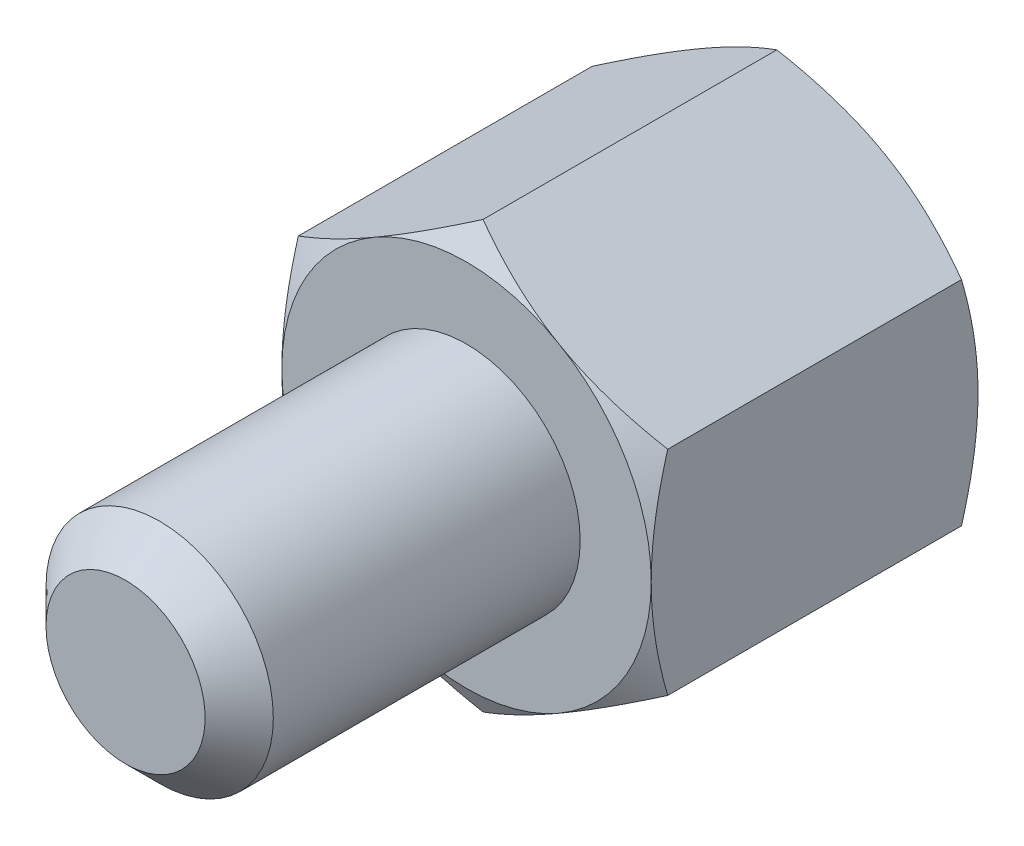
ISO-10303-21;
HEADER;
FILE_DESCRIPTION(('STEP AP214'),'2;1');
FILE_NAME('part.step','',(''),(''),'','','');
FILE_SCHEMA(('AUTOMOTIVE_DESIGN { 1 0 10303 214 1 1 1 1 }'));
ENDSEC;
DATA;
#1=APPLICATION_CONTEXT('core data for automotive mechanical design processes');
#2=APPLICATION_PROTOCOL_DEFINITION('international standard','automotive_design',2000,#1);
#3=PRODUCT_CONTEXT('',#1,'mechanical');
#4=PRODUCT('Part','Part','',(#3));
#5=PRODUCT_RELATED_PRODUCT_CATEGORY('part','',(#4));
#6=PRODUCT_DEFINITION_FORMATION('','',#4);
#7=PRODUCT_DEFINITION_CONTEXT('part definition',#1,'design');
#8=PRODUCT_DEFINITION('design','',#6,#7);
#9=PRODUCT_DEFINITION_SHAPE('','',#8);
#10=(LENGTH_UNIT() NAMED_UNIT(*) SI_UNIT(.MILLI.,.METRE.));
#11=(NAMED_UNIT(*) PLANE_ANGLE_UNIT() SI_UNIT($,.RADIAN.));
#12=(NAMED_UNIT(*) SI_UNIT($,.STERADIAN.) SOLID_ANGLE_UNIT());
#13=UNCERTAINTY_MEASURE_WITH_UNIT(LENGTH_MEASURE(1.E-05),#10,'distance_accuracy_value','');
#14=(GEOMETRIC_REPRESENTATION_CONTEXT(3) GLOBAL_UNCERTAINTY_ASSIGNED_CONTEXT((#13)) GLOBAL_UNIT_ASSIGNED_CONTEXT((#10,
#11,#12)) REPRESENTATION_CONTEXT('',''));
#15=CARTESIAN_POINT('',(0.,0.,0.));
#16=DIRECTION('',(0.,0.,1.));
#17=DIRECTION('',(1.,0.,0.));
#18=AXIS2_PLACEMENT_3D('',#15,#16,#17);
#19=CARTESIAN_POINT('',(0.,-7.50555349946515,25.));
#20=DIRECTION('',(-0.5,-0.866025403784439,0.));
#21=DIRECTION('',(-0.866025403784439,0.5,0.));
#22=AXIS2_PLACEMENT_3D('',#19,#20,#21);
#23=PLANE('',#22);
#24=DIRECTION('',(0.,0.,-1.));
#25=VECTOR('',#24,1.);
#26=CARTESIAN_POINT('',(-6.5,-3.75277674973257,25.));
#27=LINE('',#26,#25);
#28=CARTESIAN_POINT('',(-6.5,-3.75277674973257,12.4194434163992));
#29=VERTEX_POINT('',#28);
#30=CARTESIAN_POINT('',(-6.5,-3.75277674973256,2.08055658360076));
#31=VERTEX_POINT('',#30);
#32=EDGE_CURVE('E134',#29,#31,#27,.T.);
#33=ORIENTED_EDGE('',*,*,#32,.T.);
#34=CARTESIAN_POINT('',(-6.5002,-3.75266127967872,2.08062325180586));
#35=CARTESIAN_POINT('',(-6.35732254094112,-3.8351516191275,2.03300442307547));
#36=CARTESIAN_POINT('',(-6.21391236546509,-3.91794952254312,1.98754670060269));
#37=CARTESIAN_POINT('',(-5.92592736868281,-4.08421773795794,1.90154868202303));
#38=CARTESIAN_POINT('',(-5.78135207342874,-4.16768832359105,1.86101050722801));
#39=CARTESIAN_POINT('',(-5.34531134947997,-4.41943655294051,1.74757100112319));
#40=CARTESIAN_POINT('',(-5.05212471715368,-4.58870793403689,1.68304780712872));
#41=CARTESIAN_POINT('',(-4.61337625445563,-4.84201947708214,1.60738658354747));
#42=CARTESIAN_POINT('',(-4.46912536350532,-4.92530276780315,1.58583285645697));
#43=CARTESIAN_POINT('',(-4.17997178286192,-5.09224566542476,1.5496903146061));
#44=CARTESIAN_POINT('',(-4.03506915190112,-5.17590523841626,1.53510088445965));
#45=CARTESIAN_POINT('',(-3.74501222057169,-5.34336968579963,1.51325875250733));
#46=CARTESIAN_POINT('',(-3.5998583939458,-5.42717428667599,1.50599772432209));
#47=CARTESIAN_POINT('',(-3.30942466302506,-5.59485627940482,1.49896030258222));
#48=CARTESIAN_POINT('',(-3.16414476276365,-5.67873366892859,1.4991836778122));
#49=CARTESIAN_POINT('',(-2.76612405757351,-5.90853103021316,1.51008345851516));
#50=CARTESIAN_POINT('',(-2.51351353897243,-6.05437578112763,1.5283818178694));
#51=CARTESIAN_POINT('',(-2.00997032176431,-6.34509659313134,1.58640634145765));
#52=CARTESIAN_POINT('',(-1.7590393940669,-6.48997163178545,1.62615233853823));
#53=CARTESIAN_POINT('',(-1.25448277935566,-6.78127752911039,1.72550590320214));
#54=CARTESIAN_POINT('',(-1.00092075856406,-6.92767163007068,1.78553442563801));
#55=CARTESIAN_POINT('',(-0.497578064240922,-7.21827667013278,1.92177499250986));
#56=CARTESIAN_POINT('',(-0.247790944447,-7.3624913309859,1.99795503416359));
#57=CARTESIAN_POINT('',(0.000200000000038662,-7.50566896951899,2.08062325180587));
#58=B_SPLINE_CURVE_WITH_KNOTS('',3,(#34,#35,#36,#37,#38,#39,#40,#41,#42,#43,#44,#45,#46,#47,#48,
#49,#50,#51,#52,#53,#54,#55,#56,#57),.UNSPECIFIED.,.F.,.F.,(4,2,2,2,2,2,2,2,2,2,2,4),(0.,
0.515105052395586,1.03043143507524,2.06322554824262,2.56697389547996,3.07067772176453,
3.57380860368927,4.0769239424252,4.95279354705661,5.82947446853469,6.7255991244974,
7.61996451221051),.UNSPECIFIED.);
#59=CARTESIAN_POINT('',(-3.25,-5.62916512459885,1.5));
#60=VERTEX_POINT('',#59);
#61=EDGE_CURVE('E113',#31,#60,#58,.T.);
#62=ORIENTED_EDGE('',*,*,#61,.T.);
#63=CARTESIAN_POINT('',(0.,-7.50555349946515,2.08055658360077));
#64=VERTEX_POINT('',#63);
#65=EDGE_CURVE('E124',#60,#64,#58,.T.);
#66=ORIENTED_EDGE('',*,*,#65,.T.);
#67=DIRECTION('',(0.,0.,-1.));
#68=VECTOR('',#67,1.);
#69=CARTESIAN_POINT('',(0.,-7.50555349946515,25.));
#70=LINE('',#69,#68);
#71=CARTESIAN_POINT('',(0.,-7.50555349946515,12.4194434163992));
#72=VERTEX_POINT('',#71);
#73=EDGE_CURVE('E312',#72,#64,#70,.T.);
#74=ORIENTED_EDGE('',*,*,#73,.F.);
#75=CARTESIAN_POINT('',(0.000200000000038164,-7.50566896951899,12.4193767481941));
#76=CARTESIAN_POINT('',(-0.142677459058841,-7.42317863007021,12.4669955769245));
#77=CARTESIAN_POINT('',(-0.286087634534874,-7.34038072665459,12.5124532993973));
#78=CARTESIAN_POINT('',(-0.574072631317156,-7.17411251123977,12.5984513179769));
#79=CARTESIAN_POINT('',(-0.718647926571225,-7.09064192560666,12.638989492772));
#80=CARTESIAN_POINT('',(-1.15468865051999,-6.8388936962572,12.7524289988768));
#81=CARTESIAN_POINT('',(-1.44787528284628,-6.66962231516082,12.8169521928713));
#82=CARTESIAN_POINT('',(-1.88662374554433,-6.41631077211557,12.8926134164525));
#83=CARTESIAN_POINT('',(-2.03087463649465,-6.33302748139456,12.914167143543));
#84=CARTESIAN_POINT('',(-2.32002821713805,-6.16608458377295,12.9503096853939));
#85=CARTESIAN_POINT('',(-2.46493084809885,-6.08242501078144,12.9648991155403));
#86=CARTESIAN_POINT('',(-2.75498777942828,-5.91496056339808,12.9867412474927));
#87=CARTESIAN_POINT('',(-2.90014160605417,-5.83115596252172,12.9940022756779));
#88=CARTESIAN_POINT('',(-3.19057533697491,-5.66347396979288,13.0010396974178));
#89=CARTESIAN_POINT('',(-3.33585523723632,-5.57959658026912,13.0008163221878));
#90=CARTESIAN_POINT('',(-3.73387594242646,-5.34979921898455,12.9899165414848));
#91=CARTESIAN_POINT('',(-3.98648646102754,-5.20395446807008,12.9716181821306));
#92=CARTESIAN_POINT('',(-4.49002967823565,-4.91323365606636,12.9135936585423));
#93=CARTESIAN_POINT('',(-4.74096060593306,-4.76835861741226,12.8738476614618));
#94=CARTESIAN_POINT('',(-5.24551722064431,-4.47705272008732,12.7744940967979));
#95=CARTESIAN_POINT('',(-5.4990792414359,-4.33065861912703,12.714465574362));
#96=CARTESIAN_POINT('',(-6.00242193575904,-4.04005357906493,12.5782250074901));
#97=CARTESIAN_POINT('',(-6.25220905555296,-3.89583891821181,12.5020449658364));
#98=CARTESIAN_POINT('',(-6.5002,-3.75266127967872,12.4193767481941));
#99=B_SPLINE_CURVE_WITH_KNOTS('',3,(#75,#76,#77,#78,#79,#80,#81,#82,#83,#84,#85,#86,#87,#88,#89,
#90,#91,#92,#93,#94,#95,#96,#97,#98),.UNSPECIFIED.,.F.,.F.,(4,2,2,2,2,2,2,2,2,2,2,4),(0.,
0.515105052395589,1.03043143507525,2.06322554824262,2.56697389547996,3.07067772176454,
3.57380860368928,4.0769239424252,4.95279354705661,5.82947446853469,6.7255991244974,
7.6199645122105),.UNSPECIFIED.);
#100=CARTESIAN_POINT('',(-3.25,-5.62916512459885,13.));
#101=VERTEX_POINT('',#100);
#102=EDGE_CURVE('E310',#72,#101,#99,.T.);
#103=ORIENTED_EDGE('',*,*,#102,.T.);
#104=EDGE_CURVE('E199',#101,#29,#99,.T.);
#105=ORIENTED_EDGE('',*,*,#104,.T.);
#106=EDGE_LOOP('',(#33,#62,#66,#74,#103,#105));
#107=FACE_BOUND('',#106,.T.);
#108=ADVANCED_FACE('F14',(#107),#23,.T.);
#109=CARTESIAN_POINT('',(-6.5,-3.75277674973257,25.));
#110=DIRECTION('',(-1.,0.,0.));
#111=DIRECTION('',(0.,0.,-1.));
#112=AXIS2_PLACEMENT_3D('',#109,#110,#111);
#113=PLANE('',#112);
#114=DIRECTION('',(0.,0.,-1.));
#115=VECTOR('',#114,1.);
#116=CARTESIAN_POINT('',(-6.5,3.75277674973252,25.));
#117=LINE('',#116,#115);
#118=CARTESIAN_POINT('',(-6.5,3.75277674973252,12.4194434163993));
#119=VERTEX_POINT('',#118);
#120=CARTESIAN_POINT('',(-6.5,3.75277674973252,2.08055658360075));
#121=VERTEX_POINT('',#120);
#122=EDGE_CURVE('E270',#119,#121,#117,.T.);
#123=ORIENTED_EDGE('',*,*,#122,.T.);
#124=CARTESIAN_POINT('',(-6.5,-10.0879458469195,4.67582703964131));
#125=CARTESIAN_POINT('',(-6.5,-9.80399096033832,4.53805320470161));
#126=CARTESIAN_POINT('',(-6.5,-9.51938505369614,4.40159819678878));
#127=CARTESIAN_POINT('',(-6.5,-8.94852504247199,4.13206739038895));
#128=CARTESIAN_POINT('',(-6.5,-8.66227068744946,3.99899212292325));
#129=CARTESIAN_POINT('',(-6.5,-8.08629631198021,3.73629444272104));
#130=CARTESIAN_POINT('',(-6.5,-7.79656591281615,3.60669470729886));
#131=CARTESIAN_POINT('',(-6.5,-7.21480338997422,3.35278862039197));
#132=CARTESIAN_POINT('',(-6.5,-6.92277137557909,3.22848201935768));
#133=CARTESIAN_POINT('',(-6.5,-6.32647315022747,2.98265605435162));
#134=CARTESIAN_POINT('',(-6.5,-6.02211610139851,2.86135583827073));
#135=CARTESIAN_POINT('',(-6.5,-5.40984366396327,2.62791772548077));
#136=CARTESIAN_POINT('',(-6.5,-5.10192788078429,2.51578085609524));
#137=CARTESIAN_POINT('',(-6.5,-4.48262325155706,2.30360747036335));
#138=CARTESIAN_POINT('',(-6.5,-4.17124285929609,2.2035465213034));
#139=CARTESIAN_POINT('',(-6.5,-3.54401200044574,2.01873204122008));
#140=CARTESIAN_POINT('',(-6.5,-3.22816297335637,1.93397369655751));
#141=CARTESIAN_POINT('',(-6.5,-2.59359310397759,1.784276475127));
#142=CARTESIAN_POINT('',(-6.5,-2.27489819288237,1.71922943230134));
#143=CARTESIAN_POINT('',(-6.5,-1.63349190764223,1.61263826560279));
#144=CARTESIAN_POINT('',(-6.5,-1.31078091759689,1.57109191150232));
#145=CARTESIAN_POINT('',(-6.5,-0.827132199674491,1.52915613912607));
#146=CARTESIAN_POINT('',(-6.5,-0.667037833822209,1.51857908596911));
#147=CARTESIAN_POINT('',(-6.5,-0.346538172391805,1.50419915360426));
#148=CARTESIAN_POINT('',(-6.5,-0.186132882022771,1.50039616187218));
#149=CARTESIAN_POINT('',(-6.5,0.134692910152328,1.49966259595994));
#150=CARTESIAN_POINT('',(-6.5,0.29511341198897,1.50273203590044));
#151=CARTESIAN_POINT('',(-6.5,0.615682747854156,1.5156662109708));
#152=CARTESIAN_POINT('',(-6.5,0.775831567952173,1.52553128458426));
#153=CARTESIAN_POINT('',(-6.5,1.16049804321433,1.5571797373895));
#154=CARTESIAN_POINT('',(-6.5,1.38475694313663,1.58217548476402));
#155=CARTESIAN_POINT('',(-6.5,1.83160468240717,1.64413112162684));
#156=CARTESIAN_POINT('',(-6.5,2.05419329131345,1.68109263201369));
#157=CARTESIAN_POINT('',(-6.5,2.71920306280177,1.80796553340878));
#158=CARTESIAN_POINT('',(-6.5,3.15861831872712,1.9138420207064));
#159=CARTESIAN_POINT('',(-6.5,3.8156497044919,2.09736970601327));
#160=CARTESIAN_POINT('',(-6.5,4.03667592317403,2.16351437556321));
#161=CARTESIAN_POINT('',(-6.5,4.4765816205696,2.30265722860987));
#162=CARTESIAN_POINT('',(-6.5,4.69546108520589,2.37565545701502));
#163=CARTESIAN_POINT('',(-6.5,5.13114220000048,2.52733560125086));
#164=CARTESIAN_POINT('',(-6.5,5.34794451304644,2.60601563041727));
#165=CARTESIAN_POINT('',(-6.5,5.77975422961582,2.76813530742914));
#166=CARTESIAN_POINT('',(-6.5,5.99476165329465,2.85157490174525));
#167=CARTESIAN_POINT('',(-6.5,6.49850007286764,3.05245998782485));
#168=CARTESIAN_POINT('',(-6.5,6.78657491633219,3.17154770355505));
#169=CARTESIAN_POINT('',(-6.5,7.36029767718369,3.41544891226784));
#170=CARTESIAN_POINT('',(-6.5,7.64594544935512,3.54026274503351));
#171=CARTESIAN_POINT('',(-6.5,8.21525482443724,3.794477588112));
#172=CARTESIAN_POINT('',(-6.5,8.49891602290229,3.92387950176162));
#173=CARTESIAN_POINT('',(-6.5,9.06453467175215,4.18636133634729));
#174=CARTESIAN_POINT('',(-6.5,9.34649208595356,4.31944133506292));
#175=CARTESIAN_POINT('',(-6.5,9.90926980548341,4.58873402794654));
#176=CARTESIAN_POINT('',(-6.5,10.1900885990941,4.724949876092));
#177=CARTESIAN_POINT('',(-6.5,10.7505161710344,4.99985066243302));
#178=CARTESIAN_POINT('',(-6.5,11.0301249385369,5.13853562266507));
#179=CARTESIAN_POINT('',(-6.5,11.8673497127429,5.55760637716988));
#180=CARTESIAN_POINT('',(-6.5,12.4234381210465,5.84104371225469));
#181=CARTESIAN_POINT('',(-6.5,13.4866572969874,6.38991538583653));
#182=CARTESIAN_POINT('',(-6.5,13.9940244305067,6.65489390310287));
#183=CARTESIAN_POINT('',(-6.5,15.0068589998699,7.18849661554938));
#184=CARTESIAN_POINT('',(-6.5,15.5123263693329,7.4571209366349));
#185=CARTESIAN_POINT('',(-6.5,16.5205308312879,7.99648336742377));
#186=CARTESIAN_POINT('',(-6.5,17.0232715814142,8.26721465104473));
#187=CARTESIAN_POINT('',(-6.5,18.0275360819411,8.81086081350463));
#188=CARTESIAN_POINT('',(-6.5,18.5290598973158,9.08377557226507));
#189=CARTESIAN_POINT('',(-6.5,19.0301348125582,9.35750649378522));
#190=B_SPLINE_CURVE_WITH_KNOTS('',3,(#124,#125,#126,#127,#128,#129,#130,#131,#132,#133,#134,
#135,#136,#137,#138,#139,#140,#141,#142,#143,#144,#145,#146,#147,#148,#149,#150,#151,#152,#153,
#154,#155,#156,#157,#158,#159,#160,#161,#162,#163,#164,#165,#166,#167,#168,#169,#170,#171,#172,
#173,#174,#175,#176,#177,#178,#179,#180,#181,#182,#183,#184,#185,#186,#187,#188,#189),
.UNSPECIFIED.,.F.,.F.,(4,2,2,2,2,2,2,2,2,2,2,2,2,2,2,2,2,2,2,2,2,2,2,2,2,2,2,2,2,2,2,2,4),(0.,
0.946852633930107,1.89385312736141,2.84599672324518,3.79809537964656,4.78089682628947,
5.76380830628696,6.74469652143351,7.72527564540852,8.70037209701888,9.67537599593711,
10.1565846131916,10.6377852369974,11.1189868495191,11.600212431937,12.2767731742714,
12.95342560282,14.3074798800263,14.999556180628,15.6916370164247,16.3834890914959,
17.0753333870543,18.0104086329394,18.9455394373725,19.8808553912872,20.8161911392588,
21.7525127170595,22.6888426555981,24.5612563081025,26.278422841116,27.9956488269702,
29.7086501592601,31.4215579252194),.UNSPECIFIED.);
#191=CARTESIAN_POINT('',(-6.5,0.,1.5));
#192=VERTEX_POINT('',#191);
#193=EDGE_CURVE('E253',#121,#192,#190,.F.);
#194=ORIENTED_EDGE('',*,*,#193,.T.);
#195=EDGE_CURVE('E115',#192,#31,#190,.F.);
#196=ORIENTED_EDGE('',*,*,#195,.T.);
#197=ORIENTED_EDGE('',*,*,#32,.F.);
#198=CARTESIAN_POINT('',(-6.5,-10.0879458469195,9.82417296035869));
#199=CARTESIAN_POINT('',(-6.5,-9.80399096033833,9.96194679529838));
#200=CARTESIAN_POINT('',(-6.5,-9.51938505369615,10.0984018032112));
#201=CARTESIAN_POINT('',(-6.5,-8.94852504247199,10.367932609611));
#202=CARTESIAN_POINT('',(-6.5,-8.66227068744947,10.5010078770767));
#203=CARTESIAN_POINT('',(-6.5,-8.08629631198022,10.7637055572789));
#204=CARTESIAN_POINT('',(-6.5,-7.79656591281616,10.8933052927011));
#205=CARTESIAN_POINT('',(-6.5,-7.21480338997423,11.147211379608));
#206=CARTESIAN_POINT('',(-6.5,-6.9227713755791,11.2715179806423));
#207=CARTESIAN_POINT('',(-6.5,-6.32647315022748,11.5173439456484));
#208=CARTESIAN_POINT('',(-6.5,-6.02211610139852,11.6386441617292));
#209=CARTESIAN_POINT('',(-6.5,-5.40984366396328,11.8720822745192));
#210=CARTESIAN_POINT('',(-6.5,-5.1019278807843,11.9842191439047));
#211=CARTESIAN_POINT('',(-6.5,-4.48262325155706,12.1963925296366));
#212=CARTESIAN_POINT('',(-6.5,-4.1712428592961,12.2964534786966));
#213=CARTESIAN_POINT('',(-6.5,-3.54401200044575,12.4812679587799));
#214=CARTESIAN_POINT('',(-6.5,-3.22816297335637,12.5660263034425));
#215=CARTESIAN_POINT('',(-6.5,-2.59359310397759,12.715723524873));
#216=CARTESIAN_POINT('',(-6.5,-2.27489819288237,12.7807705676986));
#217=CARTESIAN_POINT('',(-6.5,-1.63349190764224,12.8873617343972));
#218=CARTESIAN_POINT('',(-6.5,-1.31078091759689,12.9289080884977));
#219=CARTESIAN_POINT('',(-6.5,-0.827132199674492,12.9708438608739));
#220=CARTESIAN_POINT('',(-6.5,-0.66703783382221,12.9814209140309));
#221=CARTESIAN_POINT('',(-6.5,-0.346538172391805,12.9958008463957));
#222=CARTESIAN_POINT('',(-6.5,-0.186132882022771,12.9996038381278));
#223=CARTESIAN_POINT('',(-6.5,0.134692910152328,13.00033740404));
#224=CARTESIAN_POINT('',(-6.5,0.29511341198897,12.9972679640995));
#225=CARTESIAN_POINT('',(-6.5,0.615682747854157,12.9843337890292));
#226=CARTESIAN_POINT('',(-6.5,0.775831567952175,12.9744687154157));
#227=CARTESIAN_POINT('',(-6.5,1.16049804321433,12.9428202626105));
#228=CARTESIAN_POINT('',(-6.5,1.38475694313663,12.917824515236));
#229=CARTESIAN_POINT('',(-6.5,1.83160468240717,12.8558688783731));
#230=CARTESIAN_POINT('',(-6.5,2.05419329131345,12.8189073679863));
#231=CARTESIAN_POINT('',(-6.5,2.71920306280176,12.6920344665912));
#232=CARTESIAN_POINT('',(-6.5,3.15861831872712,12.5861579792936));
#233=CARTESIAN_POINT('',(-6.5,3.8156497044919,12.4026302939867));
#234=CARTESIAN_POINT('',(-6.5,4.03667592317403,12.3364856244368));
#235=CARTESIAN_POINT('',(-6.5,4.4765816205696,12.1973427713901));
#236=CARTESIAN_POINT('',(-6.5,4.69546108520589,12.124344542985));
#237=CARTESIAN_POINT('',(-6.5,5.13114220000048,11.9726643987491));
#238=CARTESIAN_POINT('',(-6.5,5.34794451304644,11.8939843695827));
#239=CARTESIAN_POINT('',(-6.5,5.77975422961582,11.7318646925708));
#240=CARTESIAN_POINT('',(-6.5,5.99476165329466,11.6484250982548));
#241=CARTESIAN_POINT('',(-6.5,6.49850007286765,11.4475400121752));
#242=CARTESIAN_POINT('',(-6.5,6.78657491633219,11.3284522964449));
#243=CARTESIAN_POINT('',(-6.5,7.36029767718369,11.0845510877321));
#244=CARTESIAN_POINT('',(-6.5,7.64594544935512,10.9597372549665));
#245=CARTESIAN_POINT('',(-6.5,8.21525482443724,10.705522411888));
#246=CARTESIAN_POINT('',(-6.5,8.49891602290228,10.5761204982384));
#247=CARTESIAN_POINT('',(-6.5,9.06453467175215,10.3136386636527));
#248=CARTESIAN_POINT('',(-6.5,9.34649208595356,10.1805586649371));
#249=CARTESIAN_POINT('',(-6.5,9.90926980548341,9.91126597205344));
#250=CARTESIAN_POINT('',(-6.5,10.1900885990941,9.77505012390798));
#251=CARTESIAN_POINT('',(-6.5,10.7505161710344,9.50014933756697));
#252=CARTESIAN_POINT('',(-6.5,11.0301249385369,9.36146437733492));
#253=CARTESIAN_POINT('',(-6.5,11.8673497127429,8.9423936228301));
#254=CARTESIAN_POINT('',(-6.5,12.4234381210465,8.65895628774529));
#255=CARTESIAN_POINT('',(-6.5,13.4866572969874,8.11008461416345));
#256=CARTESIAN_POINT('',(-6.5,13.9940244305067,7.84510609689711));
#257=CARTESIAN_POINT('',(-6.5,15.0068589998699,7.31150338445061));
#258=CARTESIAN_POINT('',(-6.5,15.5123263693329,7.04287906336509));
#259=CARTESIAN_POINT('',(-6.5,16.5205308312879,6.50351663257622));
#260=CARTESIAN_POINT('',(-6.5,17.0232715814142,6.23278534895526));
#261=CARTESIAN_POINT('',(-6.5,18.0275360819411,5.68913918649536));
#262=CARTESIAN_POINT('',(-6.5,18.5290598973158,5.41622442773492));
#263=CARTESIAN_POINT('',(-6.5,19.0301348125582,5.14249350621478));
#264=B_SPLINE_CURVE_WITH_KNOTS('',3,(#198,#199,#200,#201,#202,#203,#204,#205,#206,#207,#208,
#209,#210,#211,#212,#213,#214,#215,#216,#217,#218,#219,#220,#221,#222,#223,#224,#225,#226,#227,
#228,#229,#230,#231,#232,#233,#234,#235,#236,#237,#238,#239,#240,#241,#242,#243,#244,#245,#246,
#247,#248,#249,#250,#251,#252,#253,#254,#255,#256,#257,#258,#259,#260,#261,#262,#263),
.UNSPECIFIED.,.F.,.F.,(4,2,2,2,2,2,2,2,2,2,2,2,2,2,2,2,2,2,2,2,2,2,2,2,2,2,2,2,2,2,2,2,4),(0.,
0.946852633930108,1.89385312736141,2.84599672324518,3.79809537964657,4.78089682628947,
5.76380830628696,6.74469652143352,7.72527564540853,8.7003720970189,9.67537599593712,
10.1565846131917,10.6377852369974,11.1189868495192,11.600212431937,12.2767731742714,
12.95342560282,14.3074798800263,14.999556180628,15.6916370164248,16.3834890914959,
17.0753333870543,18.0104086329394,18.9455394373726,19.8808553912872,20.8161911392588,
21.7525127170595,22.6888426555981,24.5612563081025,26.278422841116,27.9956488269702,
29.7086501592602,31.4215579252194),.UNSPECIFIED.);
#265=CARTESIAN_POINT('',(-6.5,0.,13.));
#266=VERTEX_POINT('',#265);
#267=EDGE_CURVE('E209',#29,#266,#264,.T.);
#268=ORIENTED_EDGE('',*,*,#267,.T.);
#269=EDGE_CURVE('E229',#266,#119,#264,.T.);
#270=ORIENTED_EDGE('',*,*,#269,.T.);
#271=EDGE_LOOP('',(#123,#194,#196,#197,#268,#270));
#272=FACE_BOUND('',#271,.T.);
#273=ADVANCED_FACE('F233',(#272),#113,.T.);
#274=CARTESIAN_POINT('',(0.,7.50555349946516,25.));
#275=DIRECTION('',(0.500000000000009,-0.866025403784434,0.));
#276=DIRECTION('',(-0.866025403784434,-0.500000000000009,0.));
#277=AXIS2_PLACEMENT_3D('',#274,#275,#276);
#278=PLANE('',#277);
#279=CARTESIAN_POINT('',(-6.5002,3.75266127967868,2.08062325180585));
#280=CARTESIAN_POINT('',(-6.35732254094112,3.83515161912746,2.03300442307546));
#281=CARTESIAN_POINT('',(-6.21391236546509,3.91794952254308,1.98754670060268));
#282=CARTESIAN_POINT('',(-5.92592736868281,4.08421773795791,1.90154868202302));
#283=CARTESIAN_POINT('',(-5.78135207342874,4.16768832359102,1.861010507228));
#284=CARTESIAN_POINT('',(-5.34531134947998,4.41943655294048,1.74757100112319));
#285=CARTESIAN_POINT('',(-5.05212471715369,4.58870793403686,1.68304780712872));
#286=CARTESIAN_POINT('',(-4.61337625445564,4.84201947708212,1.60738658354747));
#287=CARTESIAN_POINT('',(-4.46912536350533,4.92530276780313,1.58583285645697));
#288=CARTESIAN_POINT('',(-4.17997178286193,5.09224566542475,1.5496903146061));
#289=CARTESIAN_POINT('',(-4.03506915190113,5.17590523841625,1.53510088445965));
#290=CARTESIAN_POINT('',(-3.7450122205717,5.34336968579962,1.51325875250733));
#291=CARTESIAN_POINT('',(-3.59985839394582,5.42717428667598,1.50599772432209));
#292=CARTESIAN_POINT('',(-3.30942466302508,5.59485627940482,1.49896030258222));
#293=CARTESIAN_POINT('',(-3.16414476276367,5.67873366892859,1.4991836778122));
#294=CARTESIAN_POINT('',(-2.76612405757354,5.90853103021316,1.51008345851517));
#295=CARTESIAN_POINT('',(-2.51351353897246,6.05437578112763,1.52838181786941));
#296=CARTESIAN_POINT('',(-2.00997032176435,6.34509659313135,1.58640634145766));
#297=CARTESIAN_POINT('',(-1.75903939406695,6.48997163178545,1.62615233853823));
#298=CARTESIAN_POINT('',(-1.25448277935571,6.7812775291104,1.72550590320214));
#299=CARTESIAN_POINT('',(-1.00092075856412,6.92767163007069,1.78553442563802));
#300=CARTESIAN_POINT('',(-0.497578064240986,7.21827667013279,1.92177499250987));
#301=CARTESIAN_POINT('',(-0.247790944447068,7.36249133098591,1.99795503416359));
#302=CARTESIAN_POINT('',(0.000199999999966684,7.505668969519,2.08062325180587));
#303=B_SPLINE_CURVE_WITH_KNOTS('',3,(#279,#280,#281,#282,#283,#284,#285,#286,#287,#288,#289,
#290,#291,#292,#293,#294,#295,#296,#297,#298,#299,#300,#301,#302),.UNSPECIFIED.,.F.,.F.,(4,2,2,
2,2,2,2,2,2,2,2,4),(0.,0.515105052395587,1.03043143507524,2.06322554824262,2.56697389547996,
3.07067772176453,3.57380860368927,4.07692394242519,4.9527935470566,5.82947446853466,
6.72559912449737,7.61996451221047),.UNSPECIFIED.);
#304=CARTESIAN_POINT('',(-3.25000000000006,5.62916512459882,1.5));
#305=VERTEX_POINT('',#304);
#306=EDGE_CURVE('E244',#121,#305,#303,.T.);
#307=ORIENTED_EDGE('',*,*,#306,.F.);
#308=ORIENTED_EDGE('',*,*,#122,.F.);
#309=CARTESIAN_POINT('',(0.000199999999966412,7.505668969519,12.4193767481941));
#310=CARTESIAN_POINT('',(-0.142677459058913,7.42317863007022,12.4669955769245));
#311=CARTESIAN_POINT('',(-0.286087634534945,7.3403807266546,12.5124532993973));
#312=CARTESIAN_POINT('',(-0.574072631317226,7.17411251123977,12.5984513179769));
#313=CARTESIAN_POINT('',(-0.718647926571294,7.09064192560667,12.638989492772));
#314=CARTESIAN_POINT('',(-1.15468865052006,6.8388936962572,12.7524289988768));
#315=CARTESIAN_POINT('',(-1.44787528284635,6.66962231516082,12.8169521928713));
#316=CARTESIAN_POINT('',(-1.8866237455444,6.41631077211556,12.8926134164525));
#317=CARTESIAN_POINT('',(-2.03087463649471,6.33302748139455,12.914167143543));
#318=CARTESIAN_POINT('',(-2.32002821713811,6.16608458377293,12.9503096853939));
#319=CARTESIAN_POINT('',(-2.46493084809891,6.08242501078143,12.9648991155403));
#320=CARTESIAN_POINT('',(-2.75498777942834,5.91496056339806,12.9867412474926));
#321=CARTESIAN_POINT('',(-2.90014160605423,5.8311559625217,12.9940022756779));
#322=CARTESIAN_POINT('',(-3.19057533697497,5.66347396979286,13.0010396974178));
#323=CARTESIAN_POINT('',(-3.33585523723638,5.57959658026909,13.0008163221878));
#324=CARTESIAN_POINT('',(-3.73387594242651,5.34979921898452,12.9899165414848));
#325=CARTESIAN_POINT('',(-3.98648646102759,5.20395446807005,12.9716181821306));
#326=CARTESIAN_POINT('',(-4.49002967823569,4.91323365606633,12.9135936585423));
#327=CARTESIAN_POINT('',(-4.74096060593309,4.76835861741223,12.8738476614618));
#328=CARTESIAN_POINT('',(-5.24551722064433,4.47705272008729,12.7744940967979));
#329=CARTESIAN_POINT('',(-5.49907924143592,4.33065861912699,12.714465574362));
#330=CARTESIAN_POINT('',(-6.00242193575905,4.0400535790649,12.5782250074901));
#331=CARTESIAN_POINT('',(-6.25220905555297,3.89583891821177,12.5020449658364));
#332=CARTESIAN_POINT('',(-6.5002,3.75266127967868,12.4193767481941));
#333=B_SPLINE_CURVE_WITH_KNOTS('',3,(#309,#310,#311,#312,#313,#314,#315,#316,#317,#318,#319,
#320,#321,#322,#323,#324,#325,#326,#327,#328,#329,#330,#331,#332),.UNSPECIFIED.,.F.,.F.,(4,2,2,
2,2,2,2,2,2,2,2,4),(0.,0.515105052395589,1.03043143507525,2.06322554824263,2.56697389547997,
3.07067772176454,3.57380860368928,4.07692394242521,4.95279354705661,5.82947446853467,
6.72559912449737,7.61996451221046),.UNSPECIFIED.);
#334=CARTESIAN_POINT('',(-3.25000000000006,5.62916512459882,13.));
#335=VERTEX_POINT('',#334);
#336=EDGE_CURVE('E223',#335,#119,#333,.T.);
#337=ORIENTED_EDGE('',*,*,#336,.F.);
#338=CARTESIAN_POINT('',(0.,7.50555349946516,12.4194434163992));
#339=VERTEX_POINT('',#338);
#340=EDGE_CURVE('E228',#339,#335,#333,.T.);
#341=ORIENTED_EDGE('',*,*,#340,.F.);
#342=DIRECTION('',(0.,0.,-1.));
#343=VECTOR('',#342,1.);
#344=CARTESIAN_POINT('',(0.,7.50555349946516,25.));
#345=LINE('',#344,#343);
#346=CARTESIAN_POINT('',(0.,7.50555349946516,2.08055658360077));
#347=VERTEX_POINT('',#346);
#348=EDGE_CURVE('E278',#339,#347,#345,.T.);
#349=ORIENTED_EDGE('',*,*,#348,.T.);
#350=EDGE_CURVE('E238',#305,#347,#303,.T.);
#351=ORIENTED_EDGE('',*,*,#350,.F.);
#352=EDGE_LOOP('',(#307,#308,#337,#341,#349,#351));
#353=FACE_BOUND('',#352,.T.);
#354=ADVANCED_FACE('F230',(#353),#278,.F.);
#355=CARTESIAN_POINT('',(0.,7.50555349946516,25.));
#356=DIRECTION('',(0.5,0.866025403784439,0.));
#357=DIRECTION('',(0.866025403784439,-0.5,0.));
#358=AXIS2_PLACEMENT_3D('',#355,#356,#357);
#359=PLANE('',#358);
#360=DIRECTION('',(0.,0.,-1.));
#361=VECTOR('',#360,1.);
#362=CARTESIAN_POINT('',(6.5,3.75277674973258,25.));
#363=LINE('',#362,#361);
#364=CARTESIAN_POINT('',(6.5,3.75277674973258,12.4194434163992));
#365=VERTEX_POINT('',#364);
#366=CARTESIAN_POINT('',(6.5,3.75277674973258,2.08055658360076));
#367=VERTEX_POINT('',#366);
#368=EDGE_CURVE('E290',#365,#367,#363,.T.);
#369=ORIENTED_EDGE('',*,*,#368,.T.);
#370=CARTESIAN_POINT('',(6.5002,3.75266127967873,2.08062325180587));
#371=CARTESIAN_POINT('',(6.35732254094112,3.83515161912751,2.03300442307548));
#372=CARTESIAN_POINT('',(6.21391236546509,3.91794952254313,1.9875467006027));
#373=CARTESIAN_POINT('',(5.92592736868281,4.08421773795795,1.90154868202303));
#374=CARTESIAN_POINT('',(5.78135207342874,4.16768832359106,1.86101050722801));
#375=CARTESIAN_POINT('',(5.34531134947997,4.41943655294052,1.7475710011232));
#376=CARTESIAN_POINT('',(5.05212471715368,4.5887079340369,1.68304780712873));
#377=CARTESIAN_POINT('',(4.61337625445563,4.84201947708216,1.60738658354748));
#378=CARTESIAN_POINT('',(4.46912536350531,4.92530276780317,1.58583285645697));
#379=CARTESIAN_POINT('',(4.17997178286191,5.09224566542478,1.54969031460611));
#380=CARTESIAN_POINT('',(4.03506915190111,5.17590523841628,1.53510088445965));
#381=CARTESIAN_POINT('',(3.74501222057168,5.34336968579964,1.51325875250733));
#382=CARTESIAN_POINT('',(3.59985839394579,5.427174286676,1.50599772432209));
#383=CARTESIAN_POINT('',(3.30942466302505,5.59485627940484,1.49896030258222));
#384=CARTESIAN_POINT('',(3.16414476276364,5.67873366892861,1.4991836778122));
#385=CARTESIAN_POINT('',(2.7661240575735,5.90853103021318,1.51008345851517));
#386=CARTESIAN_POINT('',(2.51351353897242,6.05437578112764,1.52838181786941));
#387=CARTESIAN_POINT('',(2.00997032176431,6.34509659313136,1.58640634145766));
#388=CARTESIAN_POINT('',(1.7590393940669,6.48997163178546,1.62615233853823));
#389=CARTESIAN_POINT('',(1.25448277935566,6.7812775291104,1.72550590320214));
#390=CARTESIAN_POINT('',(1.00092075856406,6.9276716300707,1.78553442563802));
#391=CARTESIAN_POINT('',(0.497578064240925,7.21827667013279,1.92177499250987));
#392=CARTESIAN_POINT('',(0.247790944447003,7.36249133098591,1.99795503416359));
#393=CARTESIAN_POINT('',(-0.000200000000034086,7.505668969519,2.08062325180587));
#394=B_SPLINE_CURVE_WITH_KNOTS('',3,(#370,#371,#372,#373,#374,#375,#376,#377,#378,#379,#380,
#381,#382,#383,#384,#385,#386,#387,#388,#389,#390,#391,#392,#393),.UNSPECIFIED.,.F.,.F.,(4,2,2,
2,2,2,2,2,2,2,2,4),(0.,0.515105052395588,1.03043143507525,2.06322554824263,2.56697389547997,
3.07067772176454,3.57380860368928,4.0769239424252,4.95279354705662,5.82947446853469,
6.7255991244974,7.6199645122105),.UNSPECIFIED.);
#395=CARTESIAN_POINT('',(3.25,5.62916512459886,1.5));
#396=VERTEX_POINT('',#395);
#397=EDGE_CURVE('E129',#367,#396,#394,.T.);
#398=ORIENTED_EDGE('',*,*,#397,.T.);
#399=EDGE_CURVE('E135',#396,#347,#394,.T.);
#400=ORIENTED_EDGE('',*,*,#399,.T.);
#401=ORIENTED_EDGE('',*,*,#348,.F.);
#402=CARTESIAN_POINT('',(-0.000200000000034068,7.505668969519,12.4193767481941));
#403=CARTESIAN_POINT('',(0.142677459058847,7.42317863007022,12.4669955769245));
#404=CARTESIAN_POINT('',(0.286087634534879,7.3403807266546,12.5124532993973));
#405=CARTESIAN_POINT('',(0.574072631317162,7.17411251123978,12.5984513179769));
#406=CARTESIAN_POINT('',(0.718647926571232,7.09064192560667,12.638989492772));
#407=CARTESIAN_POINT('',(1.15468865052,6.83889369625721,12.7524289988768));
#408=CARTESIAN_POINT('',(1.44787528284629,6.66962231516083,12.8169521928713));
#409=CARTESIAN_POINT('',(1.88662374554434,6.41631077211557,12.8926134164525));
#410=CARTESIAN_POINT('',(2.03087463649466,6.33302748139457,12.914167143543));
#411=CARTESIAN_POINT('',(2.32002821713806,6.16608458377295,12.9503096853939));
#412=CARTESIAN_POINT('',(2.46493084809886,6.08242501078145,12.9648991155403));
#413=CARTESIAN_POINT('',(2.75498777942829,5.91496056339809,12.9867412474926));
#414=CARTESIAN_POINT('',(2.90014160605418,5.83115596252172,12.9940022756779));
#415=CARTESIAN_POINT('',(3.19057533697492,5.66347396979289,13.0010396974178));
#416=CARTESIAN_POINT('',(3.33585523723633,5.57959658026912,13.0008163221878));
#417=CARTESIAN_POINT('',(3.73387594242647,5.34979921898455,12.9899165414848));
#418=CARTESIAN_POINT('',(3.98648646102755,5.20395446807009,12.9716181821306));
#419=CARTESIAN_POINT('',(4.49002967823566,4.91323365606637,12.9135936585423));
#420=CARTESIAN_POINT('',(4.74096060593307,4.76835861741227,12.8738476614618));
#421=CARTESIAN_POINT('',(5.24551722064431,4.47705272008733,12.7744940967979));
#422=CARTESIAN_POINT('',(5.49907924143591,4.33065861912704,12.714465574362));
#423=CARTESIAN_POINT('',(6.00242193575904,4.04005357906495,12.5782250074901));
#424=CARTESIAN_POINT('',(6.25220905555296,3.89583891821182,12.5020449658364));
#425=CARTESIAN_POINT('',(6.5002,3.75266127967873,12.4193767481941));
#426=B_SPLINE_CURVE_WITH_KNOTS('',3,(#402,#403,#404,#405,#406,#407,#408,#409,#410,#411,#412,
#413,#414,#415,#416,#417,#418,#419,#420,#421,#422,#423,#424,#425),.UNSPECIFIED.,.F.,.F.,(4,2,2,
2,2,2,2,2,2,2,2,4),(0.,0.515105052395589,1.03043143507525,2.06322554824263,2.56697389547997,
3.07067772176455,3.57380860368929,4.07692394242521,4.95279354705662,5.82947446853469,
6.72559912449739,7.6199645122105),.UNSPECIFIED.);
#427=CARTESIAN_POINT('',(3.25,5.62916512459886,13.));
#428=VERTEX_POINT('',#427);
#429=EDGE_CURVE('E179',#339,#428,#426,.T.);
#430=ORIENTED_EDGE('',*,*,#429,.T.);
#431=EDGE_CURVE('E178',#428,#365,#426,.T.);
#432=ORIENTED_EDGE('',*,*,#431,.T.);
#433=EDGE_LOOP('',(#369,#398,#400,#401,#430,#432));
#434=FACE_BOUND('',#433,.T.);
#435=ADVANCED_FACE('F163',(#434),#359,.T.);
#436=CARTESIAN_POINT('',(6.5,-3.75277674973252,25.));
#437=DIRECTION('',(-1.,0.,0.));
#438=DIRECTION('',(0.,0.,-1.));
#439=AXIS2_PLACEMENT_3D('',#436,#437,#438);
#440=PLANE('',#439);
#441=CARTESIAN_POINT('',(6.5,-10.0879458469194,4.67582703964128));
#442=CARTESIAN_POINT('',(6.5,-9.80399096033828,4.53805320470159));
#443=CARTESIAN_POINT('',(6.5,-9.5193850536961,4.40159819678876));
#444=CARTESIAN_POINT('',(6.5,-8.94852504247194,4.13206739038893));
#445=CARTESIAN_POINT('',(6.5,-8.66227068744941,3.99899212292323));
#446=CARTESIAN_POINT('',(6.5,-8.08629631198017,3.73629444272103));
#447=CARTESIAN_POINT('',(6.5,-7.79656591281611,3.60669470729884));
#448=CARTESIAN_POINT('',(6.5,-7.21480338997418,3.35278862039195));
#449=CARTESIAN_POINT('',(6.5,-6.92277137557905,3.22848201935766));
#450=CARTESIAN_POINT('',(6.5,-6.32647315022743,2.98265605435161));
#451=CARTESIAN_POINT('',(6.5,-6.02211610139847,2.86135583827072));
#452=CARTESIAN_POINT('',(6.5,-5.40984366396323,2.62791772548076));
#453=CARTESIAN_POINT('',(6.5,-5.10192788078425,2.51578085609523));
#454=CARTESIAN_POINT('',(6.5,-4.48262325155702,2.30360747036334));
#455=CARTESIAN_POINT('',(6.5,-4.17124285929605,2.20354652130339));
#456=CARTESIAN_POINT('',(6.5,-3.5440120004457,2.01873204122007));
#457=CARTESIAN_POINT('',(6.5,-3.22816297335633,1.9339736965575));
#458=CARTESIAN_POINT('',(6.5,-2.59359310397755,1.78427647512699));
#459=CARTESIAN_POINT('',(6.5,-2.27489819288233,1.71922943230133));
#460=CARTESIAN_POINT('',(6.5,-1.63349190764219,1.61263826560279));
#461=CARTESIAN_POINT('',(6.5,-1.31078091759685,1.57109191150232));
#462=CARTESIAN_POINT('',(6.5,-0.827132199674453,1.52915613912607));
#463=CARTESIAN_POINT('',(6.5,-0.66703783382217,1.51857908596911));
#464=CARTESIAN_POINT('',(6.5,-0.346538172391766,1.50419915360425));
#465=CARTESIAN_POINT('',(6.5,-0.186132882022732,1.50039616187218));
#466=CARTESIAN_POINT('',(6.5,0.134692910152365,1.49966259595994));
#467=CARTESIAN_POINT('',(6.5,0.295113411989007,1.50273203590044));
#468=CARTESIAN_POINT('',(6.5,0.615682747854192,1.5156662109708));
#469=CARTESIAN_POINT('',(6.5,0.77583156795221,1.52553128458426));
#470=CARTESIAN_POINT('',(6.5,1.16049804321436,1.5571797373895));
#471=CARTESIAN_POINT('',(6.5,1.38475694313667,1.58217548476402));
#472=CARTESIAN_POINT('',(6.5,1.83160468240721,1.64413112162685));
#473=CARTESIAN_POINT('',(6.5,2.05419329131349,1.68109263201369));
#474=CARTESIAN_POINT('',(6.5,2.71920306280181,1.80796553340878));
#475=CARTESIAN_POINT('',(6.5,3.15861831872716,1.91384202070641));
#476=CARTESIAN_POINT('',(6.5,3.81564970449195,2.09736970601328));
#477=CARTESIAN_POINT('',(6.5,4.03667592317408,2.16351437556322));
#478=CARTESIAN_POINT('',(6.5,4.47658162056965,2.30265722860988));
#479=CARTESIAN_POINT('',(6.5,4.69546108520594,2.37565545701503));
#480=CARTESIAN_POINT('',(6.5,5.13114220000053,2.52733560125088));
#481=CARTESIAN_POINT('',(6.5,5.3479445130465,2.60601563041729));
#482=CARTESIAN_POINT('',(6.5,5.77975422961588,2.76813530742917));
#483=CARTESIAN_POINT('',(6.5,5.99476165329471,2.85157490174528));
#484=CARTESIAN_POINT('',(6.5,6.4985000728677,3.05245998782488));
#485=CARTESIAN_POINT('',(6.5,6.78657491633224,3.17154770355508));
#486=CARTESIAN_POINT('',(6.5,7.36029767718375,3.41544891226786));
#487=CARTESIAN_POINT('',(6.5,7.64594544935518,3.54026274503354));
#488=CARTESIAN_POINT('',(6.5,8.2152548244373,3.79447758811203));
#489=CARTESIAN_POINT('',(6.5,8.49891602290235,3.92387950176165));
#490=CARTESIAN_POINT('',(6.5,9.06453467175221,4.18636133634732));
#491=CARTESIAN_POINT('',(6.5,9.34649208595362,4.31944133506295));
#492=CARTESIAN_POINT('',(6.5,9.90926980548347,4.58873402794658));
#493=CARTESIAN_POINT('',(6.5,10.1900885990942,4.72494987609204));
#494=CARTESIAN_POINT('',(6.5,10.7505161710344,4.99985066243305));
#495=CARTESIAN_POINT('',(6.5,11.030124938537,5.1385356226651));
#496=CARTESIAN_POINT('',(6.5,11.867349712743,5.55760637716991));
#497=CARTESIAN_POINT('',(6.5,12.4234381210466,5.84104371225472));
#498=CARTESIAN_POINT('',(6.5,13.4866572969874,6.38991538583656));
#499=CARTESIAN_POINT('',(6.5,13.9940244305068,6.6548939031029));
#500=CARTESIAN_POINT('',(6.5,15.0068589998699,7.18849661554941));
#501=CARTESIAN_POINT('',(6.5,15.512326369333,7.45712093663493));
#502=CARTESIAN_POINT('',(6.5,16.5205308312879,7.9964833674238));
#503=CARTESIAN_POINT('',(6.5,17.0232715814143,8.26721465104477));
#504=CARTESIAN_POINT('',(6.5,18.0275360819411,8.81086081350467));
#505=CARTESIAN_POINT('',(6.5,18.5290598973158,9.08377557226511));
#506=CARTESIAN_POINT('',(6.5,19.0301348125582,9.35750649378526));
#507=B_SPLINE_CURVE_WITH_KNOTS('',3,(#441,#442,#443,#444,#445,#446,#447,#448,#449,#450,#451,
#452,#453,#454,#455,#456,#457,#458,#459,#460,#461,#462,#463,#464,#465,#466,#467,#468,#469,#470,
#471,#472,#473,#474,#475,#476,#477,#478,#479,#480,#481,#482,#483,#484,#485,#486,#487,#488,#489,
#490,#491,#492,#493,#494,#495,#496,#497,#498,#499,#500,#501,#502,#503,#504,#505,#506),
.UNSPECIFIED.,.F.,.F.,(4,2,2,2,2,2,2,2,2,2,2,2,2,2,2,2,2,2,2,2,2,2,2,2,2,2,2,2,2,2,2,2,4),(0.,
0.946852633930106,1.8938531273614,2.84599672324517,3.79809537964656,4.78089682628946,
5.76380830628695,6.7446965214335,7.72527564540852,8.70037209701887,9.6753759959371,
10.1565846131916,10.6377852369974,11.1189868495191,11.600212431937,12.2767731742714,
12.95342560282,14.3074798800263,14.999556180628,15.6916370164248,16.3834890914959,
17.0753333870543,18.0104086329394,18.9455394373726,19.8808553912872,20.8161911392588,
21.7525127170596,22.6888426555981,24.5612563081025,26.278422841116,27.9956488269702,
29.7086501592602,31.4215579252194),.UNSPECIFIED.);
#508=CARTESIAN_POINT('',(6.5,0.,1.5));
#509=VERTEX_POINT('',#508);
#510=EDGE_CURVE('E149',#367,#509,#507,.F.);
#511=ORIENTED_EDGE('',*,*,#510,.F.);
#512=ORIENTED_EDGE('',*,*,#368,.F.);
#513=CARTESIAN_POINT('',(6.5,-10.0879458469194,9.82417296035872));
#514=CARTESIAN_POINT('',(6.5,-9.80399096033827,9.96194679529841));
#515=CARTESIAN_POINT('',(6.5,-9.5193850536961,10.0984018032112));
#516=CARTESIAN_POINT('',(6.5,-8.94852504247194,10.3679326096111));
#517=CARTESIAN_POINT('',(6.5,-8.66227068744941,10.5010078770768));
#518=CARTESIAN_POINT('',(6.5,-8.08629631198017,10.763705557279));
#519=CARTESIAN_POINT('',(6.5,-7.7965659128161,10.8933052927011));
#520=CARTESIAN_POINT('',(6.5,-7.21480338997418,11.147211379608));
#521=CARTESIAN_POINT('',(6.5,-6.92277137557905,11.2715179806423));
#522=CARTESIAN_POINT('',(6.5,-6.32647315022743,11.5173439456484));
#523=CARTESIAN_POINT('',(6.5,-6.02211610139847,11.6386441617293));
#524=CARTESIAN_POINT('',(6.5,-5.40984366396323,11.8720822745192));
#525=CARTESIAN_POINT('',(6.5,-5.10192788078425,11.9842191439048));
#526=CARTESIAN_POINT('',(6.5,-4.48262325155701,12.1963925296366));
#527=CARTESIAN_POINT('',(6.5,-4.17124285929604,12.2964534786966));
#528=CARTESIAN_POINT('',(6.5,-3.5440120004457,12.4812679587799));
#529=CARTESIAN_POINT('',(6.5,-3.22816297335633,12.5660263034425));
#530=CARTESIAN_POINT('',(6.5,-2.59359310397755,12.715723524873));
#531=CARTESIAN_POINT('',(6.5,-2.27489819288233,12.7807705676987));
#532=CARTESIAN_POINT('',(6.5,-1.63349190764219,12.8873617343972));
#533=CARTESIAN_POINT('',(6.5,-1.31078091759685,12.9289080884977));
#534=CARTESIAN_POINT('',(6.5,-0.82713219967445,12.9708438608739));
#535=CARTESIAN_POINT('',(6.5,-0.667037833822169,12.9814209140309));
#536=CARTESIAN_POINT('',(6.5,-0.346538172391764,12.9958008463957));
#537=CARTESIAN_POINT('',(6.5,-0.186132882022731,12.9996038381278));
#538=CARTESIAN_POINT('',(6.5,0.134692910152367,13.00033740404));
#539=CARTESIAN_POINT('',(6.5,0.295113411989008,12.9972679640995));
#540=CARTESIAN_POINT('',(6.5,0.615682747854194,12.9843337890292));
#541=CARTESIAN_POINT('',(6.5,0.775831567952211,12.9744687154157));
#542=CARTESIAN_POINT('',(6.5,1.16049804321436,12.9428202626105));
#543=CARTESIAN_POINT('',(6.5,1.38475694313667,12.917824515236));
#544=CARTESIAN_POINT('',(6.5,1.83160468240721,12.8558688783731));
#545=CARTESIAN_POINT('',(6.5,2.05419329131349,12.8189073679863));
#546=CARTESIAN_POINT('',(6.5,2.71920306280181,12.6920344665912));
#547=CARTESIAN_POINT('',(6.5,3.15861831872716,12.5861579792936));
#548=CARTESIAN_POINT('',(6.5,3.81564970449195,12.4026302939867));
#549=CARTESIAN_POINT('',(6.5,4.03667592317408,12.3364856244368));
#550=CARTESIAN_POINT('',(6.5,4.47658162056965,12.1973427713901));
#551=CARTESIAN_POINT('',(6.5,4.69546108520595,12.124344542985));
#552=CARTESIAN_POINT('',(6.5,5.13114220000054,11.9726643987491));
#553=CARTESIAN_POINT('',(6.5,5.3479445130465,11.8939843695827));
#554=CARTESIAN_POINT('',(6.5,5.77975422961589,11.7318646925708));
#555=CARTESIAN_POINT('',(6.5,5.99476165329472,11.6484250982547));
#556=CARTESIAN_POINT('',(6.5,6.49850007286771,11.4475400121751));
#557=CARTESIAN_POINT('',(6.5,6.78657491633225,11.3284522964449));
#558=CARTESIAN_POINT('',(6.5,7.36029767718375,11.0845510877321));
#559=CARTESIAN_POINT('',(6.5,7.64594544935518,10.9597372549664));
#560=CARTESIAN_POINT('',(6.5,8.2152548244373,10.705522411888));
#561=CARTESIAN_POINT('',(6.5,8.49891602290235,10.5761204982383));
#562=CARTESIAN_POINT('',(6.5,9.06453467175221,10.3136386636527));
#563=CARTESIAN_POINT('',(6.5,9.34649208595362,10.180558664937));
#564=CARTESIAN_POINT('',(6.5,9.90926980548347,9.91126597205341));
#565=CARTESIAN_POINT('',(6.5,10.1900885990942,9.77505012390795));
#566=CARTESIAN_POINT('',(6.5,10.7505161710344,9.50014933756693));
#567=CARTESIAN_POINT('',(6.5,11.030124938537,9.36146437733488));
#568=CARTESIAN_POINT('',(6.5,11.867349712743,8.94239362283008));
#569=CARTESIAN_POINT('',(6.5,12.4234381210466,8.65895628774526));
#570=CARTESIAN_POINT('',(6.5,13.4866572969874,8.11008461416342));
#571=CARTESIAN_POINT('',(6.5,13.9940244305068,7.84510609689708));
#572=CARTESIAN_POINT('',(6.5,15.0068589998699,7.31150338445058));
#573=CARTESIAN_POINT('',(6.5,15.512326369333,7.04287906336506));
#574=CARTESIAN_POINT('',(6.5,16.520530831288,6.50351663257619));
#575=CARTESIAN_POINT('',(6.5,17.0232715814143,6.23278534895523));
#576=CARTESIAN_POINT('',(6.5,18.0275360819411,5.68913918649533));
#577=CARTESIAN_POINT('',(6.5,18.5290598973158,5.41622442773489));
#578=CARTESIAN_POINT('',(6.5,19.0301348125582,5.14249350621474));
#579=B_SPLINE_CURVE_WITH_KNOTS('',3,(#513,#514,#515,#516,#517,#518,#519,#520,#521,#522,#523,
#524,#525,#526,#527,#528,#529,#530,#531,#532,#533,#534,#535,#536,#537,#538,#539,#540,#541,#542,
#543,#544,#545,#546,#547,#548,#549,#550,#551,#552,#553,#554,#555,#556,#557,#558,#559,#560,#561,
#562,#563,#564,#565,#566,#567,#568,#569,#570,#571,#572,#573,#574,#575,#576,#577,#578),
.UNSPECIFIED.,.F.,.F.,(4,2,2,2,2,2,2,2,2,2,2,2,2,2,2,2,2,2,2,2,2,2,2,2,2,2,2,2,2,2,2,2,4),(0.,
0.946852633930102,1.8938531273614,2.84599672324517,3.79809537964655,4.78089682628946,
5.76380830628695,6.7446965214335,7.72527564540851,8.70037209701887,9.6753759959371,
10.1565846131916,10.6377852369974,11.1189868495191,11.6002124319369,12.2767731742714,
12.95342560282,14.3074798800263,14.999556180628,15.6916370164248,16.3834890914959,
17.0753333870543,18.0104086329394,18.9455394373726,19.8808553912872,20.8161911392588,
21.7525127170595,22.6888426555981,24.5612563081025,26.278422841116,27.9956488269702,
29.7086501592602,31.4215579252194),.UNSPECIFIED.);
#580=CARTESIAN_POINT('',(6.5,0.,13.));
#581=VERTEX_POINT('',#580);
#582=EDGE_CURVE('E170',#581,#365,#579,.T.);
#583=ORIENTED_EDGE('',*,*,#582,.F.);
#584=CARTESIAN_POINT('',(6.5,-3.75277674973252,12.4194434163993));
#585=VERTEX_POINT('',#584);
#586=EDGE_CURVE('E177',#585,#581,#579,.T.);
#587=ORIENTED_EDGE('',*,*,#586,.F.);
#588=DIRECTION('',(0.,0.,-1.));
#589=VECTOR('',#588,1.);
#590=CARTESIAN_POINT('',(6.5,-3.75277674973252,25.));
#591=LINE('',#590,#589);
#592=CARTESIAN_POINT('',(6.5,-3.75277674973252,2.08055658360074));
#593=VERTEX_POINT('',#592);
#594=EDGE_CURVE('E294',#585,#593,#591,.T.);
#595=ORIENTED_EDGE('',*,*,#594,.T.);
#596=EDGE_CURVE('E142',#509,#593,#507,.F.);
#597=ORIENTED_EDGE('',*,*,#596,.F.);
#598=EDGE_LOOP('',(#511,#512,#583,#587,#595,#597));
#599=FACE_BOUND('',#598,.T.);
#600=ADVANCED_FACE('F158',(#599),#440,.F.);
#601=CARTESIAN_POINT('',(0.,-7.50555349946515,25.));
#602=DIRECTION('',(-0.500000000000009,0.866025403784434,0.));
#603=DIRECTION('',(0.866025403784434,0.500000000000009,0.));
#604=AXIS2_PLACEMENT_3D('',#601,#602,#603);
#605=PLANE('',#604);
#606=CARTESIAN_POINT('',(6.5002,-3.75266127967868,2.08062325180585));
#607=CARTESIAN_POINT('',(6.35732254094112,-3.83515161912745,2.03300442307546));
#608=CARTESIAN_POINT('',(6.21391236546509,-3.91794952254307,1.98754670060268));
#609=CARTESIAN_POINT('',(5.92592736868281,-4.0842177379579,1.90154868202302));
#610=CARTESIAN_POINT('',(5.78135207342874,-4.16768832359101,1.861010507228));
#611=CARTESIAN_POINT('',(5.34531134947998,-4.41943655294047,1.74757100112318));
#612=CARTESIAN_POINT('',(5.05212471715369,-4.58870793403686,1.68304780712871));
#613=CARTESIAN_POINT('',(4.61337625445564,-4.84201947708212,1.60738658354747));
#614=CARTESIAN_POINT('',(4.46912536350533,-4.92530276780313,1.58583285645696));
#615=CARTESIAN_POINT('',(4.17997178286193,-5.09224566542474,1.5496903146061));
#616=CARTESIAN_POINT('',(4.03506915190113,-5.17590523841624,1.53510088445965));
#617=CARTESIAN_POINT('',(3.74501222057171,-5.34336968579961,1.51325875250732));
#618=CARTESIAN_POINT('',(3.59985839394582,-5.42717428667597,1.50599772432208));
#619=CARTESIAN_POINT('',(3.30942466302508,-5.59485627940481,1.49896030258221));
#620=CARTESIAN_POINT('',(3.16414476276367,-5.67873366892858,1.4991836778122));
#621=CARTESIAN_POINT('',(2.76612405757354,-5.90853103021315,1.51008345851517));
#622=CARTESIAN_POINT('',(2.51351353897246,-6.05437578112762,1.5283818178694));
#623=CARTESIAN_POINT('',(2.00997032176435,-6.34509659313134,1.58640634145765));
#624=CARTESIAN_POINT('',(1.75903939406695,-6.48997163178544,1.62615233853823));
#625=CARTESIAN_POINT('',(1.25448277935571,-6.78127752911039,1.72550590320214));
#626=CARTESIAN_POINT('',(1.00092075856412,-6.92767163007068,1.78553442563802));
#627=CARTESIAN_POINT('',(0.497578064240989,-7.21827667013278,1.92177499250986));
#628=CARTESIAN_POINT('',(0.247790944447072,-7.3624913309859,1.99795503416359));
#629=CARTESIAN_POINT('',(-0.000199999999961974,-7.50566896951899,2.08062325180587));
#630=B_SPLINE_CURVE_WITH_KNOTS('',3,(#606,#607,#608,#609,#610,#611,#612,#613,#614,#615,#616,
#617,#618,#619,#620,#621,#622,#623,#624,#625,#626,#627,#628,#629),.UNSPECIFIED.,.F.,.F.,(4,2,2,
2,2,2,2,2,2,2,2,4),(0.,0.515105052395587,1.03043143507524,2.06322554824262,2.56697389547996,
3.07067772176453,3.57380860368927,4.07692394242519,4.95279354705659,5.82947446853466,
6.72559912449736,7.61996451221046),.UNSPECIFIED.);
#631=CARTESIAN_POINT('',(3.25000000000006,-5.62916512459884,1.5));
#632=VERTEX_POINT('',#631);
#633=EDGE_CURVE('E9',#593,#632,#630,.T.);
#634=ORIENTED_EDGE('',*,*,#633,.F.);
#635=ORIENTED_EDGE('',*,*,#594,.F.);
#636=CARTESIAN_POINT('',(-0.00019999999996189,-7.50566896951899,12.4193767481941));
#637=CARTESIAN_POINT('',(0.142677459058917,-7.42317863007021,12.4669955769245));
#638=CARTESIAN_POINT('',(0.286087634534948,-7.34038072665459,12.5124532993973));
#639=CARTESIAN_POINT('',(0.574072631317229,-7.17411251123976,12.5984513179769));
#640=CARTESIAN_POINT('',(0.718647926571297,-7.09064192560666,12.638989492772));
#641=CARTESIAN_POINT('',(1.15468865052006,-6.83889369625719,12.7524289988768));
#642=CARTESIAN_POINT('',(1.44787528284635,-6.66962231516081,12.8169521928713));
#643=CARTESIAN_POINT('',(1.8866237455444,-6.41631077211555,12.8926134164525));
#644=CARTESIAN_POINT('',(2.03087463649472,-6.33302748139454,12.914167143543));
#645=CARTESIAN_POINT('',(2.32002821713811,-6.16608458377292,12.9503096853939));
#646=CARTESIAN_POINT('',(2.46493084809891,-6.08242501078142,12.9648991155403));
#647=CARTESIAN_POINT('',(2.75498777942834,-5.91496056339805,12.9867412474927));
#648=CARTESIAN_POINT('',(2.90014160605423,-5.83115596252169,12.9940022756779));
#649=CARTESIAN_POINT('',(3.19057533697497,-5.66347396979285,13.0010396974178));
#650=CARTESIAN_POINT('',(3.33585523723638,-5.57959658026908,13.0008163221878));
#651=CARTESIAN_POINT('',(3.73387594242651,-5.34979921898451,12.9899165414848));
#652=CARTESIAN_POINT('',(3.98648646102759,-5.20395446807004,12.9716181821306));
#653=CARTESIAN_POINT('',(4.49002967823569,-4.91323365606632,12.9135936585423));
#654=CARTESIAN_POINT('',(4.7409606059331,-4.76835861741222,12.8738476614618));
#655=CARTESIAN_POINT('',(5.24551722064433,-4.47705272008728,12.7744940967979));
#656=CARTESIAN_POINT('',(5.49907924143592,-4.33065861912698,12.714465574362));
#657=CARTESIAN_POINT('',(6.00242193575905,-4.04005357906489,12.5782250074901));
#658=CARTESIAN_POINT('',(6.25220905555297,-3.89583891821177,12.5020449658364));
#659=CARTESIAN_POINT('',(6.5002,-3.75266127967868,12.4193767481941));
#660=B_SPLINE_CURVE_WITH_KNOTS('',3,(#636,#637,#638,#639,#640,#641,#642,#643,#644,#645,#646,
#647,#648,#649,#650,#651,#652,#653,#654,#655,#656,#657,#658,#659),.UNSPECIFIED.,.F.,.F.,(4,2,2,
2,2,2,2,2,2,2,2,4),(0.,0.515105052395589,1.03043143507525,2.06322554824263,2.56697389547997,
3.07067772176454,3.57380860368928,4.07692394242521,4.95279354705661,5.82947446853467,
6.72559912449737,7.61996451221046),.UNSPECIFIED.);
#661=CARTESIAN_POINT('',(3.25000000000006,-5.62916512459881,13.));
#662=VERTEX_POINT('',#661);
#663=EDGE_CURVE('E326',#662,#585,#660,.T.);
#664=ORIENTED_EDGE('',*,*,#663,.F.);
#665=EDGE_CURVE('E218',#72,#662,#660,.T.);
#666=ORIENTED_EDGE('',*,*,#665,.F.);
#667=ORIENTED_EDGE('',*,*,#73,.T.);
#668=EDGE_CURVE('E18',#632,#64,#630,.T.);
#669=ORIENTED_EDGE('',*,*,#668,.F.);
#670=EDGE_LOOP('',(#634,#635,#664,#666,#667,#669));
#671=FACE_BOUND('',#670,.T.);
#672=ADVANCED_FACE('F162',(#671),#605,.F.);
#673=CARTESIAN_POINT('',(4.,0.,13.));
#674=DIRECTION('',(0.,0.,-1.));
#675=DIRECTION('',(1.,0.,0.));
#676=AXIS2_PLACEMENT_3D('',#673,#674,#675);
#677=PLANE('',#676);
#678=CARTESIAN_POINT('',(0.,0.,13.));
#679=DIRECTION('',(0.,0.,-1.));
#680=DIRECTION('',(1.,0.,0.));
#681=AXIS2_PLACEMENT_3D('',#678,#679,#680);
#682=CIRCLE('',#681,4.);
#683=CARTESIAN_POINT('',(4.,0.,13.));
#684=VERTEX_POINT('',#683);
#685=EDGE_CURVE('E297',#684,#684,#682,.T.);
#686=ORIENTED_EDGE('',*,*,#685,.T.);
#687=EDGE_LOOP('',(#686));
#688=FACE_BOUND('',#687,.T.);
#689=CARTESIAN_POINT('',(0.,0.,13.));
#690=DIRECTION('',(0.,0.,1.));
#691=DIRECTION('',(1.,0.,0.));
#692=AXIS2_PLACEMENT_3D('',#689,#690,#691);
#693=CIRCLE('',#692,6.5);
#694=EDGE_CURVE('E262',#335,#266,#693,.T.);
#695=ORIENTED_EDGE('',*,*,#694,.T.);
#696=EDGE_CURVE('E265',#266,#101,#693,.T.);
#697=ORIENTED_EDGE('',*,*,#696,.T.);
#698=EDGE_CURVE('E263',#101,#662,#693,.T.);
#699=ORIENTED_EDGE('',*,*,#698,.T.);
#700=EDGE_CURVE('E257',#662,#581,#693,.T.);
#701=ORIENTED_EDGE('',*,*,#700,.T.);
#702=EDGE_CURVE('E254',#581,#428,#693,.T.);
#703=ORIENTED_EDGE('',*,*,#702,.T.);
#704=EDGE_CURVE('E256',#428,#335,#693,.T.);
#705=ORIENTED_EDGE('',*,*,#704,.T.);
#706=EDGE_LOOP('',(#695,#697,#699,#701,#703,#705));
#707=FACE_BOUND('',#706,.T.);
#708=ADVANCED_FACE('F321',(#688,#707),#677,.F.);
#709=CARTESIAN_POINT('',(0.,0.,25.));
#710=DIRECTION('',(0.,0.,-1.));
#711=DIRECTION('',(1.,0.,0.));
#712=AXIS2_PLACEMENT_3D('',#709,#710,#711);
#713=PLANE('',#712);
#714=CARTESIAN_POINT('',(0.,0.,25.));
#715=DIRECTION('',(0.,0.,-1.));
#716=DIRECTION('',(-1.,0.,0.));
#717=AXIS2_PLACEMENT_3D('',#714,#715,#716);
#718=CIRCLE('',#717,2.8);
#719=CARTESIAN_POINT('',(-2.8,0.,25.));
#720=VERTEX_POINT('',#719);
#721=EDGE_CURVE('E306',#720,#720,#718,.F.);
#722=ORIENTED_EDGE('',*,*,#721,.T.);
#723=EDGE_LOOP('',(#722));
#724=FACE_BOUND('',#723,.T.);
#725=ADVANCED_FACE('F452',(#724),#713,.F.);
#726=CARTESIAN_POINT('',(0.,0.,-45.));
#727=DIRECTION('',(0.,0.,-1.));
#728=DIRECTION('',(1.,0.,0.));
#729=AXIS2_PLACEMENT_3D('',#726,#727,#728);
#730=CYLINDRICAL_SURFACE('',#729,4.);
#731=CARTESIAN_POINT('',(0.,0.,23.8));
#732=DIRECTION('',(0.,0.,-1.));
#733=DIRECTION('',(-1.,0.,0.));
#734=AXIS2_PLACEMENT_3D('',#731,#732,#733);
#735=CIRCLE('',#734,4.);
#736=CARTESIAN_POINT('',(-4.,0.,23.8));
#737=VERTEX_POINT('',#736);
#738=EDGE_CURVE('E304',#737,#737,#735,.T.);
#739=ORIENTED_EDGE('',*,*,#738,.T.);
#740=EDGE_LOOP('',(#739));
#741=FACE_BOUND('',#740,.T.);
#742=ORIENTED_EDGE('',*,*,#685,.F.);
#743=EDGE_LOOP('',(#742));
#744=FACE_BOUND('',#743,.T.);
#745=ADVANCED_FACE('F443',(#741,#744),#730,.T.);
#746=CARTESIAN_POINT('',(0.,0.,23.8));
#747=DIRECTION('',(0.,0.,-1.));
#748=DIRECTION('',(-1.,0.,0.));
#749=AXIS2_PLACEMENT_3D('',#746,#747,#748);
#750=CONICAL_SURFACE('',#749,4.,0.78539816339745);
#751=ORIENTED_EDGE('',*,*,#721,.F.);
#752=EDGE_LOOP('',(#751));
#753=FACE_BOUND('',#752,.T.);
#754=ORIENTED_EDGE('',*,*,#738,.F.);
#755=EDGE_LOOP('',(#754));
#756=FACE_BOUND('',#755,.T.);
#757=ADVANCED_FACE('F16',(#753,#756),#750,.T.);
#758=CARTESIAN_POINT('',(0.,0.,13.));
#759=DIRECTION('',(0.,0.,-1.));
#760=DIRECTION('',(-1.,0.,0.));
#761=AXIS2_PLACEMENT_3D('',#758,#759,#760);
#762=CONICAL_SURFACE('',#761,6.5,1.0471975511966);
#763=ORIENTED_EDGE('',*,*,#104,.F.);
#764=ORIENTED_EDGE('',*,*,#696,.F.);
#765=ORIENTED_EDGE('',*,*,#267,.F.);
#766=EDGE_LOOP('',(#763,#764,#765));
#767=FACE_BOUND('',#766,.T.);
#768=ADVANCED_FACE('F187',(#767),#762,.T.);
#769=ORIENTED_EDGE('',*,*,#665,.T.);
#770=ORIENTED_EDGE('',*,*,#698,.F.);
#771=ORIENTED_EDGE('',*,*,#102,.F.);
#772=EDGE_LOOP('',(#769,#770,#771));
#773=FACE_BOUND('',#772,.T.);
#774=ADVANCED_FACE('F191',(#773),#762,.T.);
#775=ORIENTED_EDGE('',*,*,#336,.T.);
#776=ORIENTED_EDGE('',*,*,#269,.F.);
#777=ORIENTED_EDGE('',*,*,#694,.F.);
#778=EDGE_LOOP('',(#775,#776,#777));
#779=FACE_BOUND('',#778,.T.);
#780=ADVANCED_FACE('F324',(#779),#762,.T.);
#781=ORIENTED_EDGE('',*,*,#340,.T.);
#782=ORIENTED_EDGE('',*,*,#704,.F.);
#783=ORIENTED_EDGE('',*,*,#429,.F.);
#784=EDGE_LOOP('',(#781,#782,#783));
#785=FACE_BOUND('',#784,.T.);
#786=ADVANCED_FACE('F194',(#785),#762,.T.);
#787=ORIENTED_EDGE('',*,*,#582,.T.);
#788=ORIENTED_EDGE('',*,*,#431,.F.);
#789=ORIENTED_EDGE('',*,*,#702,.F.);
#790=EDGE_LOOP('',(#787,#788,#789));
#791=FACE_BOUND('',#790,.T.);
#792=ADVANCED_FACE('F338',(#791),#762,.T.);
#793=ORIENTED_EDGE('',*,*,#586,.T.);
#794=ORIENTED_EDGE('',*,*,#700,.F.);
#795=ORIENTED_EDGE('',*,*,#663,.T.);
#796=EDGE_LOOP('',(#793,#794,#795));
#797=FACE_BOUND('',#796,.T.);
#798=ADVANCED_FACE('F193',(#797),#762,.T.);
#799=CARTESIAN_POINT('',(0.,0.,3.04953494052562));
#800=DIRECTION('',(0.,0.,1.));
#801=DIRECTION('',(1.,0.,0.));
#802=AXIS2_PLACEMENT_3D('',#799,#800,#801);
#803=CONICAL_SURFACE('',#802,9.18387324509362,1.0471975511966);
#804=CARTESIAN_POINT('',(0.,0.,1.5));
#805=DIRECTION('',(0.,0.,1.));
#806=DIRECTION('',(1.,0.,0.));
#807=AXIS2_PLACEMENT_3D('',#804,#805,#806);
#808=CIRCLE('',#807,6.5);
#809=EDGE_CURVE('E119',#60,#632,#808,.T.);
#810=ORIENTED_EDGE('',*,*,#809,.T.);
#811=ORIENTED_EDGE('',*,*,#668,.T.);
#812=ORIENTED_EDGE('',*,*,#65,.F.);
#813=EDGE_LOOP('',(#810,#811,#812));
#814=FACE_BOUND('',#813,.T.);
#815=ADVANCED_FACE('F125',(#814),#803,.T.);
#816=ORIENTED_EDGE('',*,*,#596,.T.);
#817=ORIENTED_EDGE('',*,*,#633,.T.);
#818=EDGE_CURVE('E139',#632,#509,#808,.T.);
#819=ORIENTED_EDGE('',*,*,#818,.T.);
#820=EDGE_LOOP('',(#816,#817,#819));
#821=FACE_BOUND('',#820,.T.);
#822=ADVANCED_FACE('F374',(#821),#803,.T.);
#823=ORIENTED_EDGE('',*,*,#510,.T.);
#824=EDGE_CURVE('E140',#509,#396,#808,.T.);
#825=ORIENTED_EDGE('',*,*,#824,.T.);
#826=ORIENTED_EDGE('',*,*,#397,.F.);
#827=EDGE_LOOP('',(#823,#825,#826));
#828=FACE_BOUND('',#827,.T.);
#829=ADVANCED_FACE('F155',(#828),#803,.T.);
#830=ORIENTED_EDGE('',*,*,#350,.T.);
#831=ORIENTED_EDGE('',*,*,#399,.F.);
#832=EDGE_CURVE('E43',#396,#305,#808,.T.);
#833=ORIENTED_EDGE('',*,*,#832,.T.);
#834=EDGE_LOOP('',(#830,#831,#833));
#835=FACE_BOUND('',#834,.T.);
#836=ADVANCED_FACE('F285',(#835),#803,.T.);
#837=ORIENTED_EDGE('',*,*,#306,.T.);
#838=EDGE_CURVE('E35',#305,#192,#808,.T.);
#839=ORIENTED_EDGE('',*,*,#838,.T.);
#840=ORIENTED_EDGE('',*,*,#193,.F.);
#841=EDGE_LOOP('',(#837,#839,#840));
#842=FACE_BOUND('',#841,.T.);
#843=ADVANCED_FACE('F272',(#842),#803,.T.);
#844=EDGE_CURVE('E109',#192,#60,#808,.T.);
#845=ORIENTED_EDGE('',*,*,#844,.T.);
#846=ORIENTED_EDGE('',*,*,#61,.F.);
#847=ORIENTED_EDGE('',*,*,#195,.F.);
#848=EDGE_LOOP('',(#845,#846,#847));
#849=FACE_BOUND('',#848,.T.);
#850=ADVANCED_FACE('F111',(#849),#803,.T.);
#851=CARTESIAN_POINT('',(0.,0.,0.));
#852=DIRECTION('',(0.,0.,-1.));
#853=DIRECTION('',(1.,0.,0.));
#854=AXIS2_PLACEMENT_3D('',#851,#852,#853);
#855=PLANE('',#854);
#856=CARTESIAN_POINT('',(0.,0.,0.));
#857=DIRECTION('',(0.,0.,-1.));
#858=DIRECTION('',(1.,0.,0.));
#859=AXIS2_PLACEMENT_3D('',#856,#857,#858);
#860=CIRCLE('',#859,4.);
#861=CARTESIAN_POINT('',(4.,0.,0.));
#862=VERTEX_POINT('',#861);
#863=EDGE_CURVE('E331',#862,#862,#860,.T.);
#864=ORIENTED_EDGE('',*,*,#863,.T.);
#865=EDGE_LOOP('',(#864));
#866=FACE_BOUND('',#865,.T.);
#867=ADVANCED_FACE('F195',(#866),#855,.T.);
#868=CARTESIAN_POINT('',(0.,0.,0.));
#869=DIRECTION('',(0.,0.,1.));
#870=DIRECTION('',(-1.,0.,0.));
#871=AXIS2_PLACEMENT_3D('',#868,#869,#870);
#872=CYLINDRICAL_SURFACE('',#871,4.);
#873=ORIENTED_EDGE('',*,*,#863,.F.);
#874=EDGE_LOOP('',(#873));
#875=FACE_BOUND('',#874,.T.);
#876=CARTESIAN_POINT('',(0.,0.,1.5));
#877=DIRECTION('',(0.,0.,-1.));
#878=DIRECTION('',(1.,0.,0.));
#879=AXIS2_PLACEMENT_3D('',#876,#877,#878);
#880=CIRCLE('',#879,4.);
#881=CARTESIAN_POINT('',(4.,0.,1.5));
#882=VERTEX_POINT('',#881);
#883=EDGE_CURVE('E185',#882,#882,#880,.T.);
#884=ORIENTED_EDGE('',*,*,#883,.T.);
#885=EDGE_LOOP('',(#884));
#886=FACE_BOUND('',#885,.T.);
#887=ADVANCED_FACE('F355',(#875,#886),#872,.T.);
#888=CARTESIAN_POINT('',(10.,0.,1.5));
#889=DIRECTION('',(0.,0.,1.));
#890=DIRECTION('',(-1.,0.,0.));
#891=AXIS2_PLACEMENT_3D('',#888,#889,#890);
#892=PLANE('',#891);
#893=ORIENTED_EDGE('',*,*,#883,.F.);
#894=EDGE_LOOP('',(#893));
#895=FACE_BOUND('',#894,.T.);
#896=ORIENTED_EDGE('',*,*,#824,.F.);
#897=ORIENTED_EDGE('',*,*,#818,.F.);
#898=ORIENTED_EDGE('',*,*,#809,.F.);
#899=ORIENTED_EDGE('',*,*,#844,.F.);
#900=ORIENTED_EDGE('',*,*,#838,.F.);
#901=ORIENTED_EDGE('',*,*,#832,.F.);
#902=EDGE_LOOP('',(#896,#897,#898,#899,#900,#901));
#903=FACE_BOUND('',#902,.T.);
#904=ADVANCED_FACE('F138',(#895,#903),#892,.F.);
#905=CLOSED_SHELL('',(#108,#273,#354,#435,#600,#672,#708,#725,#745,#757,#768,#774,#780,#786,
#792,#798,#815,#822,#829,#836,#843,#850,#867,#887,#904));
#906=MANIFOLD_SOLID_BREP('B1',#905);
#907=ADVANCED_BREP_SHAPE_REPRESENTATION('',(#18,#906),#14);
#908=SHAPE_DEFINITION_REPRESENTATION(#9,#907);
ENDSEC;
END-ISO-10303-21;
